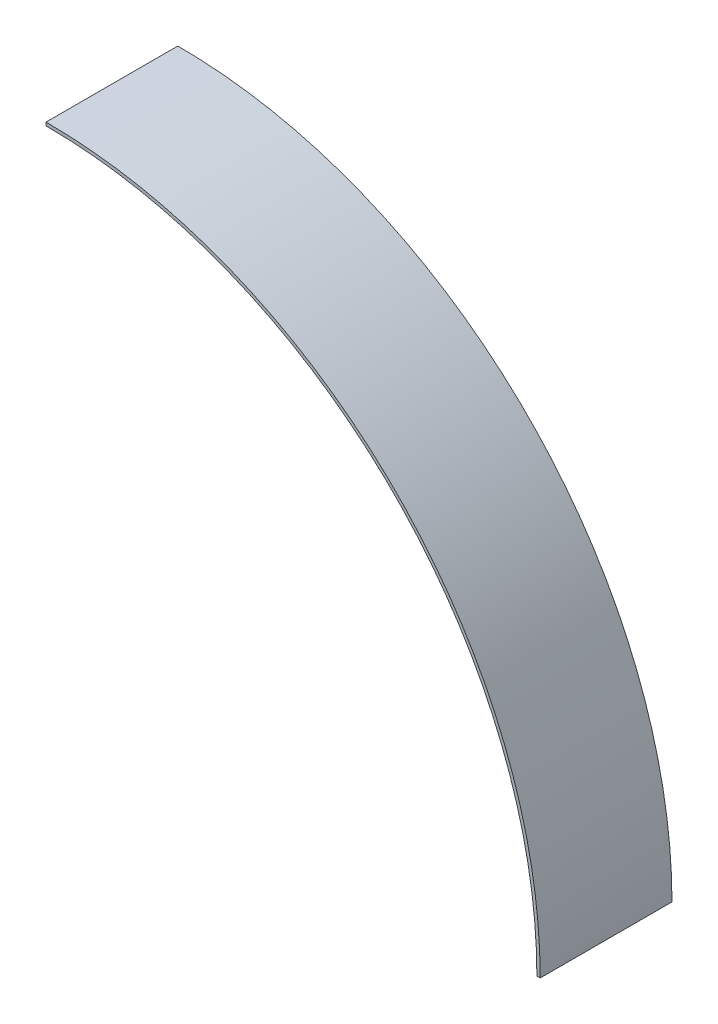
from build123d import *

# Parameters (mm, degrees)
LINEAR_AUSTRAGEN_D_NN1_DEPTH = 20


with BuildPart() as part:
    # Skizze1 → Linear-Austragen-D_nn1 (new body)
    with BuildSketch(Plane.XY):
        with BuildLine():
            ThreePointArc((75, 0), (53.033008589, 53.033008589), (0, 75))
            Line((0, 75), (0, 74.5))
            ThreePointArc((0, 74.5), (52.679455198, 52.679455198), (74.5, 0))
            Line((74.5, 0), (75, 0))
        make_face()
    extrude(amount=LINEAR_AUSTRAGEN_D_NN1_DEPTH)


solid = part.part
